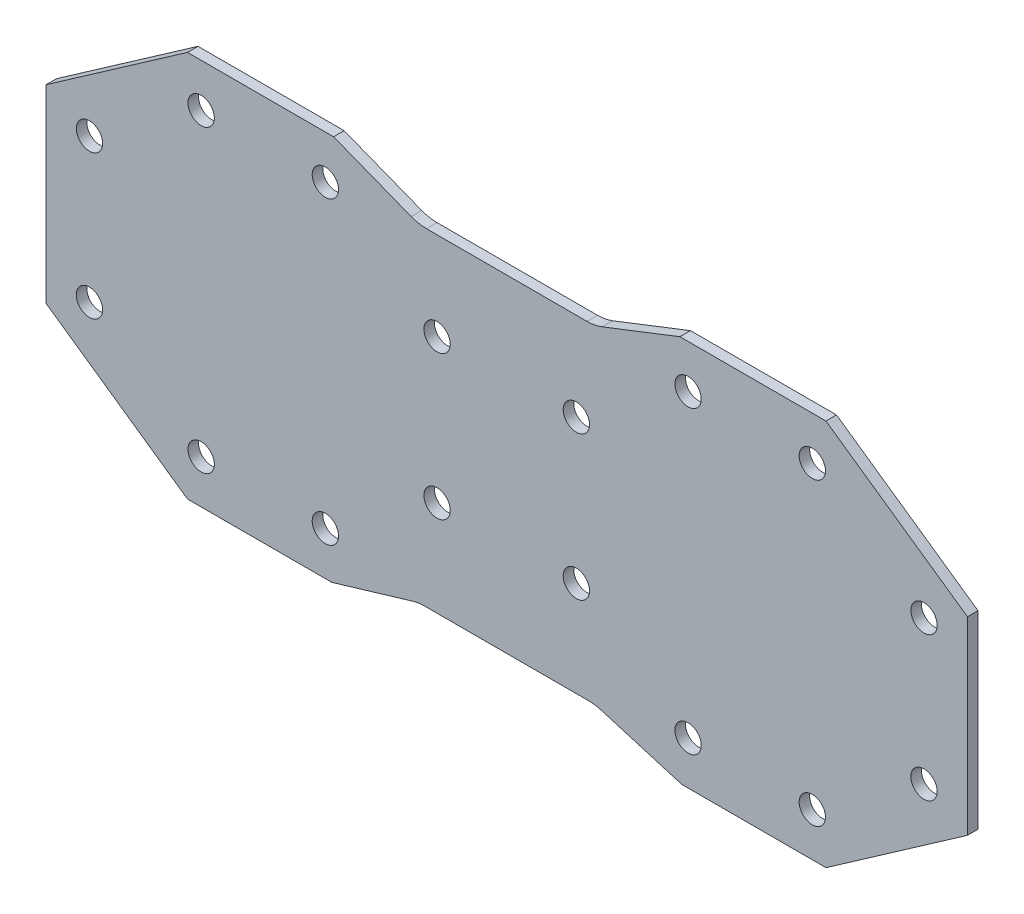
from build123d import *

# Parameters (mm, degrees)
MAIN_PLATE_DEPTH        = 25.4
CUT_EXTRUDE1_DEPTH      = 1761.901827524
CUT_EXTRUDE1_DEPTH_BACK = 1761.901827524
SKETCH5_R               = 31.75


with BuildPart() as part:
    # Sketch3 → Main Plate (new body)
    with BuildSketch(Plane(origin=(0, 0, 0), x_dir=(0, 1, 0), z_dir=(0, 0, 1))):
        with BuildLine():
            Line((466.324268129, 169.476784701), (466.324268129, -182.70492307))
            Line((466.324268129, -182.70492307), (228.234235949, -523.855268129))
            Line((228.234235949, -523.855268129), (-228.234235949, -523.855268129))
            Line((-228.234235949, -523.855268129), (-466.324268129, -182.70492307))
            Line((-466.324268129, -182.70492307), (-466.324268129, 165.037979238))
            Line((-466.324268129, 165.037979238), (-408.138164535, 360.294702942))
            ThreePointArc((-408.138164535, 360.294702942), (-404.970208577, 374.649076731), (-403.906803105, 389.310357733))
            Line((-403.906803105, 389.310357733), (-403.906803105, 784.677642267))
            ThreePointArc((-403.906803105, 784.677642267), (-404.970208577, 799.338923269), (-408.138164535, 813.693297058))
            Line((-408.138164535, 813.693297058), (-466.324268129, 1008.950020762))
            Line((-466.324268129, 1008.950020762), (-466.324268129, 1356.69292307))
            Line((-466.324268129, 1356.69292307), (-228.234235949, 1697.843268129))
            Line((-228.234235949, 1697.843268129), (228.234235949, 1697.843268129))
            Line((228.234235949, 1697.843268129), (466.324268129, 1356.69292307))
            Line((466.324268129, 1356.69292307), (466.324268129, 1004.511215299))
            Line((466.324268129, 1004.511215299), (393.274931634, 817.306570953))
            ThreePointArc((393.274931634, 817.306570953), (388.077053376, 799.164133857), (386.324268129, 780.37334606))
            Line((386.324268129, 780.37334606), (386.324268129, 393.61465394))
            ThreePointArc((386.324268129, 393.61465394), (388.077053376, 374.823866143), (393.274931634, 356.681429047))
            Line((393.274931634, 356.681429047), (466.324268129, 169.476784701))
        make_face()
    extrude(amount=MAIN_PLATE_DEPTH)

    # Sketch5 → Cut-Extrude1 (cut, two sides: drawn at the far end of the back side and taken through both)
    with BuildSketch(Plane(origin=(0, 0, 0), x_dir=(0, 1, 0), z_dir=(0, 0, 1)).offset(-CUT_EXTRUDE1_DEPTH_BACK)):
        with Locations(Location((-173.588730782, 419.080268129, 0), (0, 0, 270))):
            Circle(SKETCH5_R)
        with Locations(Location((173.588730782, 419.080268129, 0), (0, 0, 270))):
            Circle(SKETCH5_R)
        with Locations(Location((361.549268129, 149.758610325, 0), (0, 0, 270))):
            Circle(SKETCH5_R)
        with Locations(Location((361.549268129, -149.758610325, 0), (0, 0, 270))):
            Circle(SKETCH5_R)
        with Locations(Location((173.588730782, -419.080268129, 0), (0, 0, 270))):
            Circle(SKETCH5_R)
        with Locations(Location((-173.588730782, -419.080268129, 0), (0, 0, 270))):
            Circle(SKETCH5_R)
        with Locations(Location((-361.549268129, -149.758610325, 0), (0, 0, 270))):
            Circle(SKETCH5_R)
        with Locations(Location((-361.549268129, 149.758610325, 0), (0, 0, 270))):
            Circle(SKETCH5_R)
        with Locations(Location((173.588730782, 1593.068268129, 0), (0, 0, 270))):
            Circle(SKETCH5_R)
        with Locations(Location((-173.588730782, 754.907731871, 0), (0, 0, 270))):
            Circle(SKETCH5_R)
        with Locations(Location((-173.588730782, 1593.068268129, 0), (0, 0, 270))):
            Circle(SKETCH5_R)
        with Locations(Location((173.588730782, 754.907731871, 0), (0, 0, 270))):
            Circle(SKETCH5_R)
        with Locations(Location((-361.549268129, 1323.746610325, 0), (0, 0, 270))):
            Circle(SKETCH5_R)
        with Locations(Location((361.549268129, 1323.746610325, 0), (0, 0, 270))):
            Circle(SKETCH5_R)
        with Locations(Location((-361.549268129, 1024.229389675, 0), (0, 0, 270))):
            Circle(SKETCH5_R)
        with Locations(Location((361.549268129, 1024.229389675, 0), (0, 0, 270))):
            Circle(SKETCH5_R)
    extrude(amount=CUT_EXTRUDE1_DEPTH + CUT_EXTRUDE1_DEPTH_BACK, mode=Mode.SUBTRACT)


solid = part.part
